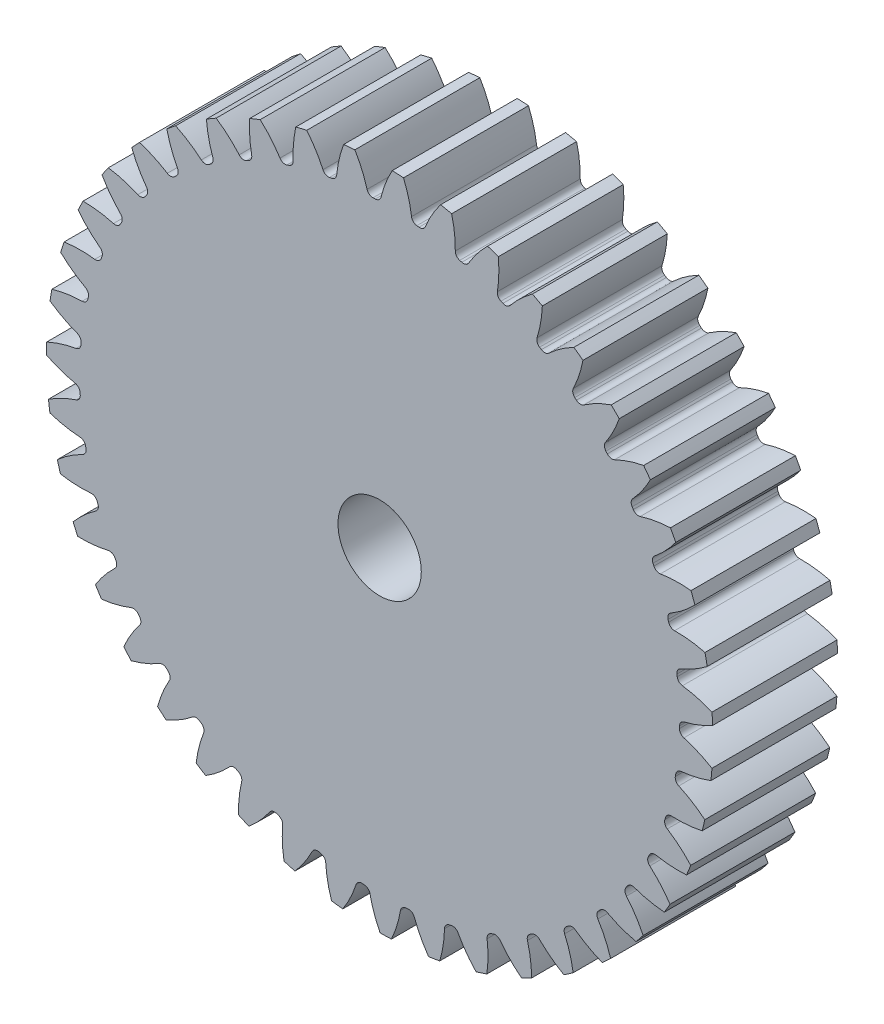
from build123d import *

# Parameters (mm, degrees)
SKETCH3_R         = 254
GEARBODY_DEPTH    = 95.25
TOOTHCUT_DEPTH    = 372.624222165
CIRPATTERN1_COUNT = 43
BOREDIA_R         = 31.75
BORE_DEPTH        = 12700


with BuildPart() as part:
    # Sketch3 → gearBody (new body)
    with BuildSketch(Plane.XY):
        Circle(SKETCH3_R)
    extrude(amount=GEARBODY_DEPTH)

    # Sketch2 → toothCut (cut, through all)
    with BuildSketch(Plane.XY):
        with BuildLine():
            ThreePointArc((228.545238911, -5.003375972), (228.562061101, -4.164639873), (228.575805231, -3.325847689))
            ThreePointArc((228.575805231, -3.325847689), (229.572220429, -0.534919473), (232.065320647, 1.067133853))
            ThreePointArc((232.065320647, 1.067133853), (243.321268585, 4.664773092), (254, 9.724819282))
            ThreePointArc((254, 9.724819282), (254.14391218, -4.630767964), (253.477121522, -18.971583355))
            ThreePointArc((253.477121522, -18.971583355), (242.98981604, -13.52586983), (231.872401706, -9.520564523))
            ThreePointArc((231.872401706, -9.520564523), (229.439319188, -7.828750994), (228.545238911, -5.003375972))
        make_face()
    toothcut = extrude(amount=TOOTHCUT_DEPTH, mode=Mode.SUBTRACT)

    # CirPattern1: toothCut ×43 about axis
    cirpattern1_axis = Axis((0, 0, 0), (0, 0, 1))
    for i in range(1, CIRPATTERN1_COUNT):
        add(toothcut.rotate(cirpattern1_axis, i * 360 / CIRPATTERN1_COUNT), mode=Mode.SUBTRACT)

    # boreDia → bore (cut, symmetric)
    with BuildSketch(Plane.XY):
        Circle(BOREDIA_R)
    extrude(amount=BORE_DEPTH, both=True, mode=Mode.SUBTRACT)


solid = part.part
